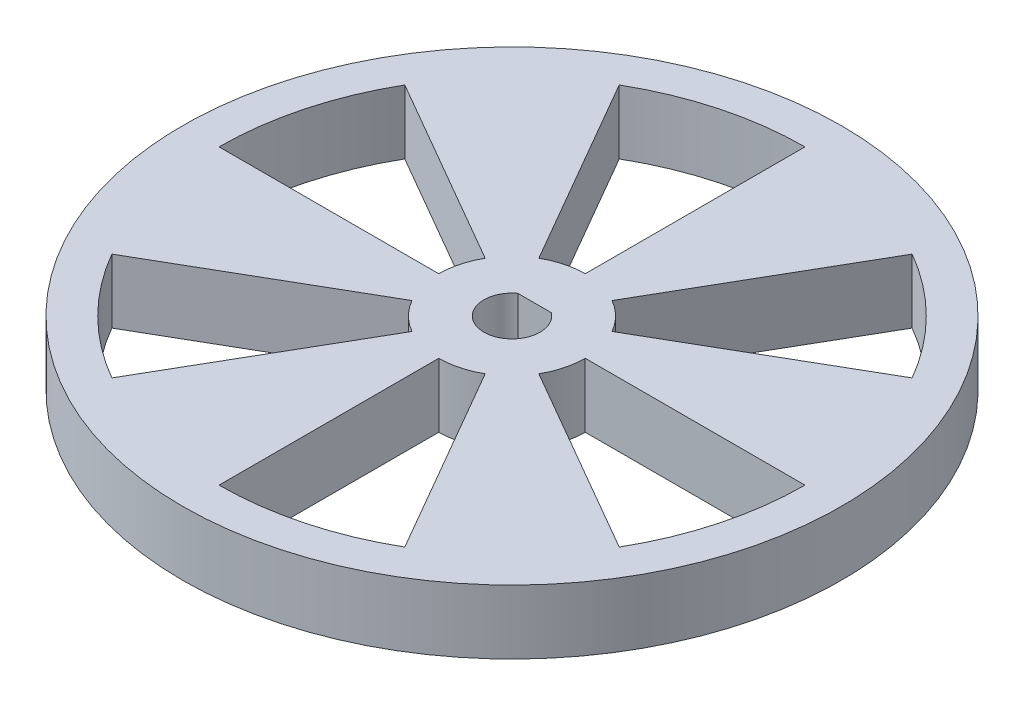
from build123d import *

# Parameters (mm, degrees)
SKETCH1_R      = 36
EXTRUDE1_DEPTH = 7


with BuildPart() as part:
    # Sketch1 → Extrude1 (new body)
    with BuildSketch(Plane(origin=(0, 0, 0), x_dir=(1, 0, 0), z_dir=(0, 1, 0))):
        with Locations(Location((0, 0, 0), (0, 0, 270))):
            Circle(SKETCH1_R)
        with BuildLine():
            Line((0, -8), (0, -32))
            ThreePointArc((0, -32), (8.282209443, -30.909626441), (16, -27.712812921))
            Line((16, -27.712812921), (4, -6.92820323))
            ThreePointArc((4, -6.92820323), (2.070552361, -7.72740661), (0, -8))
        make_face(mode=Mode.SUBTRACT)
        with BuildLine():
            Line((-4, 6.92820323), (-16, 27.712812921))
            ThreePointArc((-16, 27.712812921), (-8.282209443, 30.909626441), (0, 32))
            Line((0, 32), (0, 8))
            ThreePointArc((0, 8), (-2.070552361, 7.72740661), (-4, 6.92820323))
        make_face(mode=Mode.SUBTRACT)
        with BuildLine():
            Line((-6.92820323, 4), (-27.712812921, 16))
            ThreePointArc((-27.712812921, 16), (-30.909626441, 8.282209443), (-32, 0))
            Line((-32, 0), (-8, 0))
            ThreePointArc((-8, 0), (-7.72740661, 2.070552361), (-6.92820323, 4))
        make_face(mode=Mode.SUBTRACT)
        with BuildLine():
            Line((1.831876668, 2.46356), (-1.831876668, 2.46356))
            ThreePointArc((-1.831876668, 2.46356), (0, -3.07), (1.831876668, 2.46356))
        make_face(mode=Mode.SUBTRACT)
        with BuildLine():
            Line((6.92820323, 4), (27.712812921, 16))
            ThreePointArc((27.712812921, 16), (22.627416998, 22.627416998), (16, 27.712812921))
            Line((16, 27.712812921), (4, 6.92820323))
            ThreePointArc((4, 6.92820323), (5.656854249, 5.656854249), (6.92820323, 4))
        make_face(mode=Mode.SUBTRACT)
        with BuildLine():
            Line((6.92820323, -4), (27.712812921, -16))
            ThreePointArc((27.712812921, -16), (30.909626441, -8.282209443), (32, 0))
            Line((32, 0), (8, 0))
            ThreePointArc((8, 0), (7.72740661, -2.070552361), (6.92820323, -4))
        make_face(mode=Mode.SUBTRACT)
        with BuildLine():
            Line((-6.92820323, -4), (-27.712812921, -16))
            ThreePointArc((-27.712812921, -16), (-22.627416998, -22.627416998), (-16, -27.712812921))
            Line((-16, -27.712812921), (-4, -6.92820323))
            ThreePointArc((-4, -6.92820323), (-5.656854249, -5.656854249), (-6.92820323, -4))
        make_face(mode=Mode.SUBTRACT)
    extrude(amount=EXTRUDE1_DEPTH)


solid = part.part
